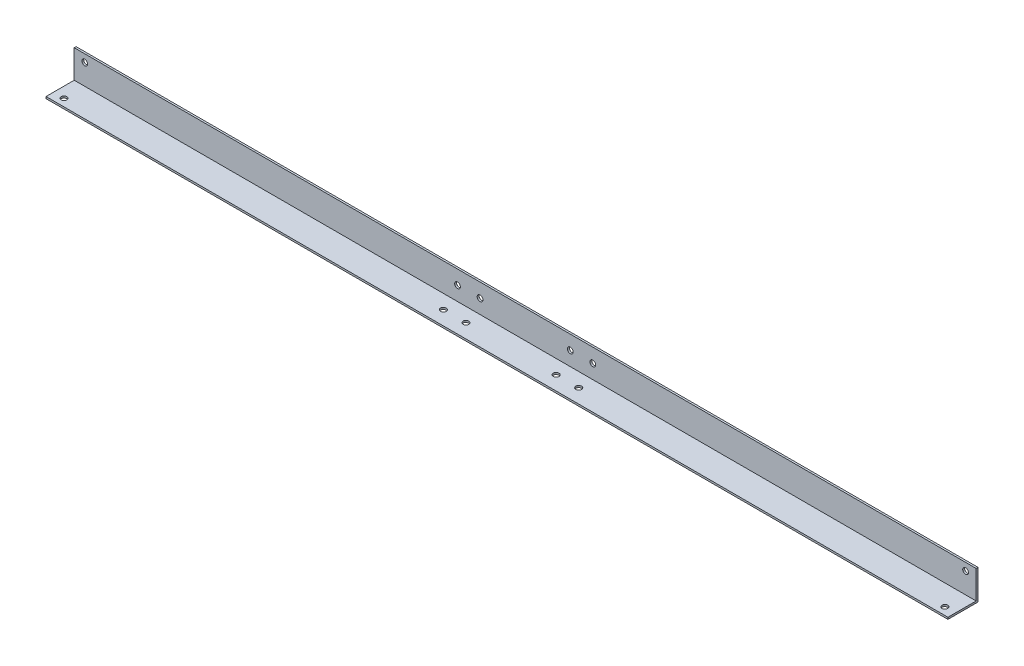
ISO-10303-21;
HEADER;
FILE_DESCRIPTION(('STEP AP214'),'2;1');
FILE_NAME('part.step','',(''),(''),'','','');
FILE_SCHEMA(('AUTOMOTIVE_DESIGN { 1 0 10303 214 1 1 1 1 }'));
ENDSEC;
DATA;
#1=APPLICATION_CONTEXT('core data for automotive mechanical design processes');
#2=APPLICATION_PROTOCOL_DEFINITION('international standard','automotive_design',2000,#1);
#3=PRODUCT_CONTEXT('',#1,'mechanical');
#4=PRODUCT('Part','Part','',(#3));
#5=PRODUCT_RELATED_PRODUCT_CATEGORY('part','',(#4));
#6=PRODUCT_DEFINITION_FORMATION('','',#4);
#7=PRODUCT_DEFINITION_CONTEXT('part definition',#1,'design');
#8=PRODUCT_DEFINITION('design','',#6,#7);
#9=PRODUCT_DEFINITION_SHAPE('','',#8);
#10=(LENGTH_UNIT() NAMED_UNIT(*) SI_UNIT(.MILLI.,.METRE.));
#11=(NAMED_UNIT(*) PLANE_ANGLE_UNIT() SI_UNIT($,.RADIAN.));
#12=(NAMED_UNIT(*) SI_UNIT($,.STERADIAN.) SOLID_ANGLE_UNIT());
#13=UNCERTAINTY_MEASURE_WITH_UNIT(LENGTH_MEASURE(1.E-05),#10,'distance_accuracy_value','');
#14=(GEOMETRIC_REPRESENTATION_CONTEXT(3) GLOBAL_UNCERTAINTY_ASSIGNED_CONTEXT((#13)) GLOBAL_UNIT_ASSIGNED_CONTEXT((#10,
#11,#12)) REPRESENTATION_CONTEXT('',''));
#15=CARTESIAN_POINT('',(0.,0.,0.));
#16=DIRECTION('',(0.,0.,1.));
#17=DIRECTION('',(1.,0.,0.));
#18=AXIS2_PLACEMENT_3D('',#15,#16,#17);
#19=CARTESIAN_POINT('',(381.,0.,0.));
#20=DIRECTION('',(0.,1.,0.));
#21=DIRECTION('',(0.,0.,1.));
#22=AXIS2_PLACEMENT_3D('',#19,#20,#21);
#23=PLANE('',#22);
#24=CARTESIAN_POINT('',(372.11,0.,19.05));
#25=DIRECTION('',(0.,1.,0.));
#26=DIRECTION('',(0.,0.,1.));
#27=AXIS2_PLACEMENT_3D('',#24,#25,#26);
#28=CIRCLE('',#27,2.42569999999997);
#29=CARTESIAN_POINT('',(372.11,0.,21.4757));
#30=VERTEX_POINT('',#29);
#31=EDGE_CURVE('E148',#30,#30,#28,.T.);
#32=ORIENTED_EDGE('',*,*,#31,.T.);
#33=EDGE_LOOP('',(#32));
#34=FACE_BOUND('',#33,.T.);
#35=CARTESIAN_POINT('',(-38.1,0.,13.49375));
#36=DIRECTION('',(0.,1.,0.));
#37=DIRECTION('',(0.,0.,-1.));
#38=AXIS2_PLACEMENT_3D('',#35,#36,#37);
#39=CIRCLE('',#38,2.4257);
#40=CARTESIAN_POINT('',(-38.1,0.,11.06805));
#41=VERTEX_POINT('',#40);
#42=EDGE_CURVE('E180',#41,#41,#39,.T.);
#43=ORIENTED_EDGE('',*,*,#42,.T.);
#44=EDGE_LOOP('',(#43));
#45=FACE_BOUND('',#44,.T.);
#46=CARTESIAN_POINT('',(-372.11,0.,19.05));
#47=DIRECTION('',(0.,1.,0.));
#48=DIRECTION('',(0.,0.,-1.));
#49=AXIS2_PLACEMENT_3D('',#46,#47,#48);
#50=CIRCLE('',#49,2.42569999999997);
#51=CARTESIAN_POINT('',(-372.11,0.,16.6243));
#52=VERTEX_POINT('',#51);
#53=EDGE_CURVE('E191',#52,#52,#50,.T.);
#54=ORIENTED_EDGE('',*,*,#53,.T.);
#55=EDGE_LOOP('',(#54));
#56=FACE_BOUND('',#55,.T.);
#57=CARTESIAN_POINT('',(57.15,0.,13.49375));
#58=DIRECTION('',(0.,1.,0.));
#59=DIRECTION('',(0.,0.,1.));
#60=AXIS2_PLACEMENT_3D('',#57,#58,#59);
#61=CIRCLE('',#60,2.4257);
#62=CARTESIAN_POINT('',(57.15,0.,15.91945));
#63=VERTEX_POINT('',#62);
#64=EDGE_CURVE('E195',#63,#63,#61,.T.);
#65=ORIENTED_EDGE('',*,*,#64,.T.);
#66=EDGE_LOOP('',(#65));
#67=FACE_BOUND('',#66,.T.);
#68=CARTESIAN_POINT('',(38.1,0.,13.49375));
#69=DIRECTION('',(0.,1.,0.));
#70=DIRECTION('',(0.,0.,1.));
#71=AXIS2_PLACEMENT_3D('',#68,#69,#70);
#72=CIRCLE('',#71,2.4257);
#73=CARTESIAN_POINT('',(38.1,0.,15.91945));
#74=VERTEX_POINT('',#73);
#75=EDGE_CURVE('E187',#74,#74,#72,.T.);
#76=ORIENTED_EDGE('',*,*,#75,.T.);
#77=EDGE_LOOP('',(#76));
#78=FACE_BOUND('',#77,.T.);
#79=CARTESIAN_POINT('',(-57.15,0.,13.49375));
#80=DIRECTION('',(0.,1.,0.));
#81=DIRECTION('',(0.,0.,-1.));
#82=AXIS2_PLACEMENT_3D('',#79,#80,#81);
#83=CIRCLE('',#82,2.4257);
#84=CARTESIAN_POINT('',(-57.15,0.,11.06805));
#85=VERTEX_POINT('',#84);
#86=EDGE_CURVE('E182',#85,#85,#83,.T.);
#87=ORIENTED_EDGE('',*,*,#86,.T.);
#88=EDGE_LOOP('',(#87));
#89=FACE_BOUND('',#88,.T.);
#90=DIRECTION('',(0.,0.,-1.));
#91=VECTOR('',#90,1.);
#92=CARTESIAN_POINT('',(-381.,0.,0.));
#93=LINE('',#92,#91);
#94=CARTESIAN_POINT('',(-381.,0.,25.4));
#95=VERTEX_POINT('',#94);
#96=CARTESIAN_POINT('',(-381.,0.,0.));
#97=VERTEX_POINT('',#96);
#98=EDGE_CURVE('E123',#95,#97,#93,.T.);
#99=ORIENTED_EDGE('',*,*,#98,.T.);
#100=DIRECTION('',(-1.,0.,0.));
#101=VECTOR('',#100,1.);
#102=CARTESIAN_POINT('',(381.,0.,0.));
#103=LINE('',#102,#101);
#104=CARTESIAN_POINT('',(381.,0.,0.));
#105=VERTEX_POINT('',#104);
#106=EDGE_CURVE('E11',#105,#97,#103,.T.);
#107=ORIENTED_EDGE('',*,*,#106,.F.);
#108=DIRECTION('',(0.,0.,-1.));
#109=VECTOR('',#108,1.);
#110=CARTESIAN_POINT('',(381.,0.,0.));
#111=LINE('',#110,#109);
#112=CARTESIAN_POINT('',(381.,0.,25.4));
#113=VERTEX_POINT('',#112);
#114=EDGE_CURVE('E137',#113,#105,#111,.T.);
#115=ORIENTED_EDGE('',*,*,#114,.F.);
#116=DIRECTION('',(-1.,0.,0.));
#117=VECTOR('',#116,1.);
#118=CARTESIAN_POINT('',(381.,0.,25.4));
#119=LINE('',#118,#117);
#120=EDGE_CURVE('E122',#113,#95,#119,.T.);
#121=ORIENTED_EDGE('',*,*,#120,.T.);
#122=EDGE_LOOP('',(#99,#107,#115,#121));
#123=FACE_BOUND('',#122,.T.);
#124=ADVANCED_FACE('F39',(#34,#45,#56,#67,#78,#89,#123),#23,.F.);
#125=CARTESIAN_POINT('',(381.,0.,0.));
#126=DIRECTION('',(0.,0.,1.));
#127=DIRECTION('',(1.,0.,0.));
#128=AXIS2_PLACEMENT_3D('',#125,#126,#127);
#129=PLANE('',#128);
#130=CARTESIAN_POINT('',(372.11,19.05,0.));
#131=DIRECTION('',(0.,0.,-1.));
#132=DIRECTION('',(0.,1.,0.));
#133=AXIS2_PLACEMENT_3D('',#130,#131,#132);
#134=CIRCLE('',#133,2.42569999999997);
#135=CARTESIAN_POINT('',(372.11,21.4757,0.));
#136=VERTEX_POINT('',#135);
#137=EDGE_CURVE('E163',#136,#136,#134,.T.);
#138=ORIENTED_EDGE('',*,*,#137,.F.);
#139=EDGE_LOOP('',(#138));
#140=FACE_BOUND('',#139,.T.);
#141=CARTESIAN_POINT('',(-38.1,13.49375,0.));
#142=DIRECTION('',(0.,0.,-1.));
#143=DIRECTION('',(0.,-1.,0.));
#144=AXIS2_PLACEMENT_3D('',#141,#142,#143);
#145=CIRCLE('',#144,2.4257);
#146=CARTESIAN_POINT('',(-38.1,11.06805,0.));
#147=VERTEX_POINT('',#146);
#148=EDGE_CURVE('E424',#147,#147,#145,.T.);
#149=ORIENTED_EDGE('',*,*,#148,.F.);
#150=EDGE_LOOP('',(#149));
#151=FACE_BOUND('',#150,.T.);
#152=CARTESIAN_POINT('',(-372.11,19.05,0.));
#153=DIRECTION('',(0.,0.,-1.));
#154=DIRECTION('',(0.,-1.,0.));
#155=AXIS2_PLACEMENT_3D('',#152,#153,#154);
#156=CIRCLE('',#155,2.42569999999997);
#157=CARTESIAN_POINT('',(-372.11,16.6243,0.));
#158=VERTEX_POINT('',#157);
#159=EDGE_CURVE('E416',#158,#158,#156,.T.);
#160=ORIENTED_EDGE('',*,*,#159,.F.);
#161=EDGE_LOOP('',(#160));
#162=FACE_BOUND('',#161,.T.);
#163=CARTESIAN_POINT('',(57.15,13.49375,0.));
#164=DIRECTION('',(0.,0.,-1.));
#165=DIRECTION('',(0.,1.,0.));
#166=AXIS2_PLACEMENT_3D('',#163,#164,#165);
#167=CIRCLE('',#166,2.4257);
#168=CARTESIAN_POINT('',(57.15,15.91945,0.));
#169=VERTEX_POINT('',#168);
#170=EDGE_CURVE('E423',#169,#169,#167,.T.);
#171=ORIENTED_EDGE('',*,*,#170,.F.);
#172=EDGE_LOOP('',(#171));
#173=FACE_BOUND('',#172,.T.);
#174=CARTESIAN_POINT('',(38.1,13.49375,0.));
#175=DIRECTION('',(0.,0.,-1.));
#176=DIRECTION('',(0.,1.,0.));
#177=AXIS2_PLACEMENT_3D('',#174,#175,#176);
#178=CIRCLE('',#177,2.4257);
#179=CARTESIAN_POINT('',(38.1,15.91945,0.));
#180=VERTEX_POINT('',#179);
#181=EDGE_CURVE('E428',#180,#180,#178,.T.);
#182=ORIENTED_EDGE('',*,*,#181,.F.);
#183=EDGE_LOOP('',(#182));
#184=FACE_BOUND('',#183,.T.);
#185=CARTESIAN_POINT('',(-57.15,13.49375,0.));
#186=DIRECTION('',(0.,0.,-1.));
#187=DIRECTION('',(0.,-1.,0.));
#188=AXIS2_PLACEMENT_3D('',#185,#186,#187);
#189=CIRCLE('',#188,2.4257);
#190=CARTESIAN_POINT('',(-57.15,11.06805,0.));
#191=VERTEX_POINT('',#190);
#192=EDGE_CURVE('E430',#191,#191,#189,.T.);
#193=ORIENTED_EDGE('',*,*,#192,.F.);
#194=EDGE_LOOP('',(#193));
#195=FACE_BOUND('',#194,.T.);
#196=DIRECTION('',(0.,1.,0.));
#197=VECTOR('',#196,1.);
#198=CARTESIAN_POINT('',(-381.,0.,0.));
#199=LINE('',#198,#197);
#200=CARTESIAN_POINT('',(-381.,25.4,0.));
#201=VERTEX_POINT('',#200);
#202=EDGE_CURVE('E126',#97,#201,#199,.T.);
#203=ORIENTED_EDGE('',*,*,#202,.T.);
#204=DIRECTION('',(-1.,0.,0.));
#205=VECTOR('',#204,1.);
#206=CARTESIAN_POINT('',(381.,25.4,0.));
#207=LINE('',#206,#205);
#208=CARTESIAN_POINT('',(381.,25.4,0.));
#209=VERTEX_POINT('',#208);
#210=EDGE_CURVE('E48',#209,#201,#207,.T.);
#211=ORIENTED_EDGE('',*,*,#210,.F.);
#212=DIRECTION('',(0.,1.,0.));
#213=VECTOR('',#212,1.);
#214=CARTESIAN_POINT('',(381.,0.,0.));
#215=LINE('',#214,#213);
#216=EDGE_CURVE('E94',#105,#209,#215,.T.);
#217=ORIENTED_EDGE('',*,*,#216,.F.);
#218=ORIENTED_EDGE('',*,*,#106,.T.);
#219=EDGE_LOOP('',(#203,#211,#217,#218));
#220=FACE_BOUND('',#219,.T.);
#221=ADVANCED_FACE('F205',(#140,#151,#162,#173,#184,#195,#220),#129,.F.);
#222=CARTESIAN_POINT('',(381.,25.4,0.));
#223=DIRECTION('',(0.,-1.,0.));
#224=DIRECTION('',(0.,0.,-1.));
#225=AXIS2_PLACEMENT_3D('',#222,#223,#224);
#226=PLANE('',#225);
#227=DIRECTION('',(0.,0.,1.));
#228=VECTOR('',#227,1.);
#229=CARTESIAN_POINT('',(-381.,25.4,0.));
#230=LINE('',#229,#228);
#231=CARTESIAN_POINT('',(-381.,25.4,1.5875));
#232=VERTEX_POINT('',#231);
#233=EDGE_CURVE('E132',#201,#232,#230,.T.);
#234=ORIENTED_EDGE('',*,*,#233,.T.);
#235=DIRECTION('',(-1.,0.,0.));
#236=VECTOR('',#235,1.);
#237=CARTESIAN_POINT('',(381.,25.4,1.5875));
#238=LINE('',#237,#236);
#239=CARTESIAN_POINT('',(381.,25.4,1.5875));
#240=VERTEX_POINT('',#239);
#241=EDGE_CURVE('E117',#240,#232,#238,.T.);
#242=ORIENTED_EDGE('',*,*,#241,.F.);
#243=DIRECTION('',(0.,0.,1.));
#244=VECTOR('',#243,1.);
#245=CARTESIAN_POINT('',(381.,25.4,0.));
#246=LINE('',#245,#244);
#247=EDGE_CURVE('E110',#209,#240,#246,.T.);
#248=ORIENTED_EDGE('',*,*,#247,.F.);
#249=ORIENTED_EDGE('',*,*,#210,.T.);
#250=EDGE_LOOP('',(#234,#242,#248,#249));
#251=FACE_BOUND('',#250,.T.);
#252=ADVANCED_FACE('F202',(#251),#226,.F.);
#253=CARTESIAN_POINT('',(381.,1.5875,1.5875));
#254=DIRECTION('',(0.,0.,-1.));
#255=DIRECTION('',(-1.,0.,0.));
#256=AXIS2_PLACEMENT_3D('',#253,#254,#255);
#257=PLANE('',#256);
#258=CARTESIAN_POINT('',(372.11,19.05,1.5875));
#259=DIRECTION('',(0.,0.,-1.));
#260=DIRECTION('',(-1.,0.,0.));
#261=AXIS2_PLACEMENT_3D('',#258,#259,#260);
#262=CIRCLE('',#261,2.42569999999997);
#263=CARTESIAN_POINT('',(369.6843,19.05,1.5875));
#264=VERTEX_POINT('',#263);
#265=EDGE_CURVE('E45',#264,#264,#262,.T.);
#266=ORIENTED_EDGE('',*,*,#265,.T.);
#267=EDGE_LOOP('',(#266));
#268=FACE_BOUND('',#267,.T.);
#269=CARTESIAN_POINT('',(-38.1,13.49375,1.5875));
#270=DIRECTION('',(0.,0.,-1.));
#271=DIRECTION('',(-1.,0.,0.));
#272=AXIS2_PLACEMENT_3D('',#269,#270,#271);
#273=CIRCLE('',#272,2.4257);
#274=CARTESIAN_POINT('',(-40.5257,13.49375,1.5875));
#275=VERTEX_POINT('',#274);
#276=EDGE_CURVE('E174',#275,#275,#273,.T.);
#277=ORIENTED_EDGE('',*,*,#276,.T.);
#278=EDGE_LOOP('',(#277));
#279=FACE_BOUND('',#278,.T.);
#280=CARTESIAN_POINT('',(-372.11,19.05,1.5875));
#281=DIRECTION('',(0.,0.,-1.));
#282=DIRECTION('',(-1.,0.,0.));
#283=AXIS2_PLACEMENT_3D('',#280,#281,#282);
#284=CIRCLE('',#283,2.42569999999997);
#285=CARTESIAN_POINT('',(-374.5357,19.05,1.5875));
#286=VERTEX_POINT('',#285);
#287=EDGE_CURVE('E168',#286,#286,#284,.T.);
#288=ORIENTED_EDGE('',*,*,#287,.T.);
#289=EDGE_LOOP('',(#288));
#290=FACE_BOUND('',#289,.T.);
#291=CARTESIAN_POINT('',(57.15,13.49375,1.5875));
#292=DIRECTION('',(0.,0.,-1.));
#293=DIRECTION('',(-1.,0.,0.));
#294=AXIS2_PLACEMENT_3D('',#291,#292,#293);
#295=CIRCLE('',#294,2.4257);
#296=CARTESIAN_POINT('',(54.7243,13.49375,1.5875));
#297=VERTEX_POINT('',#296);
#298=EDGE_CURVE('E170',#297,#297,#295,.T.);
#299=ORIENTED_EDGE('',*,*,#298,.T.);
#300=EDGE_LOOP('',(#299));
#301=FACE_BOUND('',#300,.T.);
#302=CARTESIAN_POINT('',(38.1,13.49375,1.5875));
#303=DIRECTION('',(0.,0.,-1.));
#304=DIRECTION('',(-1.,0.,0.));
#305=AXIS2_PLACEMENT_3D('',#302,#303,#304);
#306=CIRCLE('',#305,2.4257);
#307=CARTESIAN_POINT('',(35.6743,13.49375,1.5875));
#308=VERTEX_POINT('',#307);
#309=EDGE_CURVE('E162',#308,#308,#306,.T.);
#310=ORIENTED_EDGE('',*,*,#309,.T.);
#311=EDGE_LOOP('',(#310));
#312=FACE_BOUND('',#311,.T.);
#313=CARTESIAN_POINT('',(-57.15,13.49375,1.5875));
#314=DIRECTION('',(0.,0.,-1.));
#315=DIRECTION('',(-1.,0.,0.));
#316=AXIS2_PLACEMENT_3D('',#313,#314,#315);
#317=CIRCLE('',#316,2.4257);
#318=CARTESIAN_POINT('',(-59.5757,13.49375,1.5875));
#319=VERTEX_POINT('',#318);
#320=EDGE_CURVE('E159',#319,#319,#317,.T.);
#321=ORIENTED_EDGE('',*,*,#320,.T.);
#322=EDGE_LOOP('',(#321));
#323=FACE_BOUND('',#322,.T.);
#324=DIRECTION('',(0.,-1.,0.));
#325=VECTOR('',#324,1.);
#326=CARTESIAN_POINT('',(-381.,1.5875,1.5875));
#327=LINE('',#326,#325);
#328=CARTESIAN_POINT('',(-381.,1.5875,1.5875));
#329=VERTEX_POINT('',#328);
#330=EDGE_CURVE('E113',#232,#329,#327,.T.);
#331=ORIENTED_EDGE('',*,*,#330,.T.);
#332=DIRECTION('',(-1.,0.,0.));
#333=VECTOR('',#332,1.);
#334=CARTESIAN_POINT('',(381.,1.5875,1.5875));
#335=LINE('',#334,#333);
#336=CARTESIAN_POINT('',(381.,1.5875,1.5875));
#337=VERTEX_POINT('',#336);
#338=EDGE_CURVE('E115',#337,#329,#335,.T.);
#339=ORIENTED_EDGE('',*,*,#338,.F.);
#340=DIRECTION('',(0.,-1.,0.));
#341=VECTOR('',#340,1.);
#342=CARTESIAN_POINT('',(381.,1.5875,1.5875));
#343=LINE('',#342,#341);
#344=EDGE_CURVE('E101',#240,#337,#343,.T.);
#345=ORIENTED_EDGE('',*,*,#344,.F.);
#346=ORIENTED_EDGE('',*,*,#241,.T.);
#347=EDGE_LOOP('',(#331,#339,#345,#346));
#348=FACE_BOUND('',#347,.T.);
#349=ADVANCED_FACE('F114',(#268,#279,#290,#301,#312,#323,#348),#257,.F.);
#350=CARTESIAN_POINT('',(381.,1.5875,1.5875));
#351=DIRECTION('',(0.,-1.,0.));
#352=DIRECTION('',(0.,0.,-1.));
#353=AXIS2_PLACEMENT_3D('',#350,#351,#352);
#354=PLANE('',#353);
#355=CARTESIAN_POINT('',(372.11,1.5875,19.05));
#356=DIRECTION('',(0.,-1.,0.));
#357=DIRECTION('',(0.,0.,-1.));
#358=AXIS2_PLACEMENT_3D('',#355,#356,#357);
#359=CIRCLE('',#358,2.42569999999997);
#360=CARTESIAN_POINT('',(372.11,1.5875,16.6243));
#361=VERTEX_POINT('',#360);
#362=EDGE_CURVE('E129',#361,#361,#359,.F.);
#363=ORIENTED_EDGE('',*,*,#362,.F.);
#364=EDGE_LOOP('',(#363));
#365=FACE_BOUND('',#364,.T.);
#366=CARTESIAN_POINT('',(-38.1,1.5875,13.49375));
#367=DIRECTION('',(0.,-1.,0.));
#368=DIRECTION('',(0.,0.,-1.));
#369=AXIS2_PLACEMENT_3D('',#366,#367,#368);
#370=CIRCLE('',#369,2.4257);
#371=CARTESIAN_POINT('',(-38.1,1.5875,11.06805));
#372=VERTEX_POINT('',#371);
#373=EDGE_CURVE('E154',#372,#372,#370,.F.);
#374=ORIENTED_EDGE('',*,*,#373,.F.);
#375=EDGE_LOOP('',(#374));
#376=FACE_BOUND('',#375,.T.);
#377=CARTESIAN_POINT('',(-372.11,1.5875,19.05));
#378=DIRECTION('',(0.,-1.,0.));
#379=DIRECTION('',(0.,0.,-1.));
#380=AXIS2_PLACEMENT_3D('',#377,#378,#379);
#381=CIRCLE('',#380,2.42569999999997);
#382=CARTESIAN_POINT('',(-372.11,1.5875,16.6243));
#383=VERTEX_POINT('',#382);
#384=EDGE_CURVE('E155',#383,#383,#381,.F.);
#385=ORIENTED_EDGE('',*,*,#384,.F.);
#386=EDGE_LOOP('',(#385));
#387=FACE_BOUND('',#386,.T.);
#388=CARTESIAN_POINT('',(57.15,1.5875,13.49375));
#389=DIRECTION('',(0.,-1.,0.));
#390=DIRECTION('',(0.,0.,-1.));
#391=AXIS2_PLACEMENT_3D('',#388,#389,#390);
#392=CIRCLE('',#391,2.4257);
#393=CARTESIAN_POINT('',(57.15,1.5875,11.06805));
#394=VERTEX_POINT('',#393);
#395=EDGE_CURVE('E149',#394,#394,#392,.F.);
#396=ORIENTED_EDGE('',*,*,#395,.F.);
#397=EDGE_LOOP('',(#396));
#398=FACE_BOUND('',#397,.T.);
#399=CARTESIAN_POINT('',(38.1,1.5875,13.49375));
#400=DIRECTION('',(0.,-1.,0.));
#401=DIRECTION('',(0.,0.,-1.));
#402=AXIS2_PLACEMENT_3D('',#399,#400,#401);
#403=CIRCLE('',#402,2.4257);
#404=CARTESIAN_POINT('',(38.1,1.5875,11.06805));
#405=VERTEX_POINT('',#404);
#406=EDGE_CURVE('E144',#405,#405,#403,.F.);
#407=ORIENTED_EDGE('',*,*,#406,.F.);
#408=EDGE_LOOP('',(#407));
#409=FACE_BOUND('',#408,.T.);
#410=CARTESIAN_POINT('',(-57.15,1.5875,13.49375));
#411=DIRECTION('',(0.,-1.,0.));
#412=DIRECTION('',(0.,0.,-1.));
#413=AXIS2_PLACEMENT_3D('',#410,#411,#412);
#414=CIRCLE('',#413,2.4257);
#415=CARTESIAN_POINT('',(-57.15,1.5875,11.06805));
#416=VERTEX_POINT('',#415);
#417=EDGE_CURVE('E142',#416,#416,#414,.F.);
#418=ORIENTED_EDGE('',*,*,#417,.F.);
#419=EDGE_LOOP('',(#418));
#420=FACE_BOUND('',#419,.T.);
#421=DIRECTION('',(0.,0.,1.));
#422=VECTOR('',#421,1.);
#423=CARTESIAN_POINT('',(-381.,1.5875,1.5875));
#424=LINE('',#423,#422);
#425=CARTESIAN_POINT('',(-381.,1.5875,25.4));
#426=VERTEX_POINT('',#425);
#427=EDGE_CURVE('E78',#329,#426,#424,.T.);
#428=ORIENTED_EDGE('',*,*,#427,.T.);
#429=DIRECTION('',(-1.,0.,0.));
#430=VECTOR('',#429,1.);
#431=CARTESIAN_POINT('',(381.,1.5875,25.4));
#432=LINE('',#431,#430);
#433=CARTESIAN_POINT('',(381.,1.5875,25.4));
#434=VERTEX_POINT('',#433);
#435=EDGE_CURVE('E119',#434,#426,#432,.T.);
#436=ORIENTED_EDGE('',*,*,#435,.F.);
#437=DIRECTION('',(0.,0.,1.));
#438=VECTOR('',#437,1.);
#439=CARTESIAN_POINT('',(381.,1.5875,1.5875));
#440=LINE('',#439,#438);
#441=EDGE_CURVE('E104',#337,#434,#440,.T.);
#442=ORIENTED_EDGE('',*,*,#441,.F.);
#443=ORIENTED_EDGE('',*,*,#338,.T.);
#444=EDGE_LOOP('',(#428,#436,#442,#443));
#445=FACE_BOUND('',#444,.T.);
#446=ADVANCED_FACE('F116',(#365,#376,#387,#398,#409,#420,#445),#354,.F.);
#447=CARTESIAN_POINT('',(381.,0.,25.4));
#448=DIRECTION('',(0.,0.,-1.));
#449=DIRECTION('',(-1.,0.,0.));
#450=AXIS2_PLACEMENT_3D('',#447,#448,#449);
#451=PLANE('',#450);
#452=DIRECTION('',(0.,-1.,0.));
#453=VECTOR('',#452,1.);
#454=CARTESIAN_POINT('',(-381.,0.,25.4));
#455=LINE('',#454,#453);
#456=EDGE_CURVE('E88',#426,#95,#455,.T.);
#457=ORIENTED_EDGE('',*,*,#456,.T.);
#458=ORIENTED_EDGE('',*,*,#120,.F.);
#459=DIRECTION('',(0.,-1.,0.));
#460=VECTOR('',#459,1.);
#461=CARTESIAN_POINT('',(381.,0.,25.4));
#462=LINE('',#461,#460);
#463=EDGE_CURVE('E60',#434,#113,#462,.T.);
#464=ORIENTED_EDGE('',*,*,#463,.F.);
#465=ORIENTED_EDGE('',*,*,#435,.T.);
#466=EDGE_LOOP('',(#457,#458,#464,#465));
#467=FACE_BOUND('',#466,.T.);
#468=ADVANCED_FACE('F209',(#467),#451,.F.);
#469=CARTESIAN_POINT('',(381.,0.,0.));
#470=DIRECTION('',(-1.,0.,0.));
#471=DIRECTION('',(0.,0.,1.));
#472=AXIS2_PLACEMENT_3D('',#469,#470,#471);
#473=PLANE('',#472);
#474=ORIENTED_EDGE('',*,*,#114,.T.);
#475=ORIENTED_EDGE('',*,*,#216,.T.);
#476=ORIENTED_EDGE('',*,*,#247,.T.);
#477=ORIENTED_EDGE('',*,*,#344,.T.);
#478=ORIENTED_EDGE('',*,*,#441,.T.);
#479=ORIENTED_EDGE('',*,*,#463,.T.);
#480=EDGE_LOOP('',(#474,#475,#476,#477,#478,#479));
#481=FACE_BOUND('',#480,.T.);
#482=ADVANCED_FACE('F103',(#481),#473,.F.);
#483=CARTESIAN_POINT('',(-381.,0.,0.));
#484=DIRECTION('',(-1.,0.,0.));
#485=DIRECTION('',(0.,0.,1.));
#486=AXIS2_PLACEMENT_3D('',#483,#484,#485);
#487=PLANE('',#486);
#488=ORIENTED_EDGE('',*,*,#98,.F.);
#489=ORIENTED_EDGE('',*,*,#456,.F.);
#490=ORIENTED_EDGE('',*,*,#427,.F.);
#491=ORIENTED_EDGE('',*,*,#330,.F.);
#492=ORIENTED_EDGE('',*,*,#233,.F.);
#493=ORIENTED_EDGE('',*,*,#202,.F.);
#494=EDGE_LOOP('',(#488,#489,#490,#491,#492,#493));
#495=FACE_BOUND('',#494,.T.);
#496=ADVANCED_FACE('F208',(#495),#487,.T.);
#497=CARTESIAN_POINT('',(-57.15,25.4,13.49375));
#498=DIRECTION('',(0.,-1.,0.));
#499=DIRECTION('',(0.,0.,-1.));
#500=AXIS2_PLACEMENT_3D('',#497,#498,#499);
#501=CYLINDRICAL_SURFACE('',#500,2.4257);
#502=ORIENTED_EDGE('',*,*,#86,.F.);
#503=EDGE_LOOP('',(#502));
#504=FACE_BOUND('',#503,.T.);
#505=ORIENTED_EDGE('',*,*,#417,.T.);
#506=EDGE_LOOP('',(#505));
#507=FACE_BOUND('',#506,.T.);
#508=ADVANCED_FACE('F238',(#504,#507),#501,.F.);
#509=CARTESIAN_POINT('',(38.1,25.4,13.49375));
#510=DIRECTION('',(0.,-1.,0.));
#511=DIRECTION('',(0.,0.,-1.));
#512=AXIS2_PLACEMENT_3D('',#509,#510,#511);
#513=CYLINDRICAL_SURFACE('',#512,2.4257);
#514=ORIENTED_EDGE('',*,*,#75,.F.);
#515=EDGE_LOOP('',(#514));
#516=FACE_BOUND('',#515,.T.);
#517=ORIENTED_EDGE('',*,*,#406,.T.);
#518=EDGE_LOOP('',(#517));
#519=FACE_BOUND('',#518,.T.);
#520=ADVANCED_FACE('F245',(#516,#519),#513,.F.);
#521=CARTESIAN_POINT('',(57.15,25.4,13.49375));
#522=DIRECTION('',(0.,-1.,0.));
#523=DIRECTION('',(0.,0.,-1.));
#524=AXIS2_PLACEMENT_3D('',#521,#522,#523);
#525=CYLINDRICAL_SURFACE('',#524,2.4257);
#526=ORIENTED_EDGE('',*,*,#64,.F.);
#527=EDGE_LOOP('',(#526));
#528=FACE_BOUND('',#527,.T.);
#529=ORIENTED_EDGE('',*,*,#395,.T.);
#530=EDGE_LOOP('',(#529));
#531=FACE_BOUND('',#530,.T.);
#532=ADVANCED_FACE('F248',(#528,#531),#525,.F.);
#533=CARTESIAN_POINT('',(-372.11,25.4,19.05));
#534=DIRECTION('',(0.,-1.,0.));
#535=DIRECTION('',(0.,0.,-1.));
#536=AXIS2_PLACEMENT_3D('',#533,#534,#535);
#537=CYLINDRICAL_SURFACE('',#536,2.42569999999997);
#538=ORIENTED_EDGE('',*,*,#53,.F.);
#539=EDGE_LOOP('',(#538));
#540=FACE_BOUND('',#539,.T.);
#541=ORIENTED_EDGE('',*,*,#384,.T.);
#542=EDGE_LOOP('',(#541));
#543=FACE_BOUND('',#542,.T.);
#544=ADVANCED_FACE('F254',(#540,#543),#537,.F.);
#545=CARTESIAN_POINT('',(-38.1,25.4,13.49375));
#546=DIRECTION('',(0.,-1.,0.));
#547=DIRECTION('',(0.,0.,-1.));
#548=AXIS2_PLACEMENT_3D('',#545,#546,#547);
#549=CYLINDRICAL_SURFACE('',#548,2.4257);
#550=ORIENTED_EDGE('',*,*,#42,.F.);
#551=EDGE_LOOP('',(#550));
#552=FACE_BOUND('',#551,.T.);
#553=ORIENTED_EDGE('',*,*,#373,.T.);
#554=EDGE_LOOP('',(#553));
#555=FACE_BOUND('',#554,.T.);
#556=ADVANCED_FACE('F256',(#552,#555),#549,.F.);
#557=CARTESIAN_POINT('',(372.11,25.4,19.05));
#558=DIRECTION('',(0.,-1.,0.));
#559=DIRECTION('',(0.,0.,-1.));
#560=AXIS2_PLACEMENT_3D('',#557,#558,#559);
#561=CYLINDRICAL_SURFACE('',#560,2.42569999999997);
#562=ORIENTED_EDGE('',*,*,#31,.F.);
#563=EDGE_LOOP('',(#562));
#564=FACE_BOUND('',#563,.T.);
#565=ORIENTED_EDGE('',*,*,#362,.T.);
#566=EDGE_LOOP('',(#565));
#567=FACE_BOUND('',#566,.T.);
#568=ADVANCED_FACE('F281',(#564,#567),#561,.F.);
#569=CARTESIAN_POINT('',(-57.15,13.49375,25.4));
#570=DIRECTION('',(0.,0.,-1.));
#571=DIRECTION('',(0.,1.,0.));
#572=AXIS2_PLACEMENT_3D('',#569,#570,#571);
#573=CYLINDRICAL_SURFACE('',#572,2.4257);
#574=ORIENTED_EDGE('',*,*,#192,.T.);
#575=EDGE_LOOP('',(#574));
#576=FACE_BOUND('',#575,.T.);
#577=ORIENTED_EDGE('',*,*,#320,.F.);
#578=EDGE_LOOP('',(#577));
#579=FACE_BOUND('',#578,.T.);
#580=ADVANCED_FACE('F292',(#576,#579),#573,.F.);
#581=CARTESIAN_POINT('',(38.1,13.49375,25.4));
#582=DIRECTION('',(0.,0.,-1.));
#583=DIRECTION('',(0.,1.,0.));
#584=AXIS2_PLACEMENT_3D('',#581,#582,#583);
#585=CYLINDRICAL_SURFACE('',#584,2.4257);
#586=ORIENTED_EDGE('',*,*,#181,.T.);
#587=EDGE_LOOP('',(#586));
#588=FACE_BOUND('',#587,.T.);
#589=ORIENTED_EDGE('',*,*,#309,.F.);
#590=EDGE_LOOP('',(#589));
#591=FACE_BOUND('',#590,.T.);
#592=ADVANCED_FACE('F312',(#588,#591),#585,.F.);
#593=CARTESIAN_POINT('',(57.15,13.49375,25.4));
#594=DIRECTION('',(0.,0.,-1.));
#595=DIRECTION('',(0.,1.,0.));
#596=AXIS2_PLACEMENT_3D('',#593,#594,#595);
#597=CYLINDRICAL_SURFACE('',#596,2.4257);
#598=ORIENTED_EDGE('',*,*,#170,.T.);
#599=EDGE_LOOP('',(#598));
#600=FACE_BOUND('',#599,.T.);
#601=ORIENTED_EDGE('',*,*,#298,.F.);
#602=EDGE_LOOP('',(#601));
#603=FACE_BOUND('',#602,.T.);
#604=ADVANCED_FACE('F322',(#600,#603),#597,.F.);
#605=CARTESIAN_POINT('',(-372.11,19.05,25.4));
#606=DIRECTION('',(0.,0.,-1.));
#607=DIRECTION('',(0.,1.,0.));
#608=AXIS2_PLACEMENT_3D('',#605,#606,#607);
#609=CYLINDRICAL_SURFACE('',#608,2.42569999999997);
#610=ORIENTED_EDGE('',*,*,#159,.T.);
#611=EDGE_LOOP('',(#610));
#612=FACE_BOUND('',#611,.T.);
#613=ORIENTED_EDGE('',*,*,#287,.F.);
#614=EDGE_LOOP('',(#613));
#615=FACE_BOUND('',#614,.T.);
#616=ADVANCED_FACE('F334',(#612,#615),#609,.F.);
#617=CARTESIAN_POINT('',(-38.1,13.49375,25.4));
#618=DIRECTION('',(0.,0.,-1.));
#619=DIRECTION('',(0.,1.,0.));
#620=AXIS2_PLACEMENT_3D('',#617,#618,#619);
#621=CYLINDRICAL_SURFACE('',#620,2.4257);
#622=ORIENTED_EDGE('',*,*,#148,.T.);
#623=EDGE_LOOP('',(#622));
#624=FACE_BOUND('',#623,.T.);
#625=ORIENTED_EDGE('',*,*,#276,.F.);
#626=EDGE_LOOP('',(#625));
#627=FACE_BOUND('',#626,.T.);
#628=ADVANCED_FACE('F345',(#624,#627),#621,.F.);
#629=CARTESIAN_POINT('',(372.11,19.05,25.4));
#630=DIRECTION('',(0.,0.,-1.));
#631=DIRECTION('',(0.,1.,0.));
#632=AXIS2_PLACEMENT_3D('',#629,#630,#631);
#633=CYLINDRICAL_SURFACE('',#632,2.42569999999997);
#634=ORIENTED_EDGE('',*,*,#137,.T.);
#635=EDGE_LOOP('',(#634));
#636=FACE_BOUND('',#635,.T.);
#637=ORIENTED_EDGE('',*,*,#265,.F.);
#638=EDGE_LOOP('',(#637));
#639=FACE_BOUND('',#638,.T.);
#640=ADVANCED_FACE('F352',(#636,#639),#633,.F.);
#641=CLOSED_SHELL('',(#124,#221,#252,#349,#446,#468,#482,#496,#508,#520,#532,#544,#556,#568,
#580,#592,#604,#616,#628,#640));
#642=MANIFOLD_SOLID_BREP('B2',#641);
#643=ADVANCED_BREP_SHAPE_REPRESENTATION('',(#18,#642),#14);
#644=SHAPE_DEFINITION_REPRESENTATION(#9,#643);
ENDSEC;
END-ISO-10303-21;
